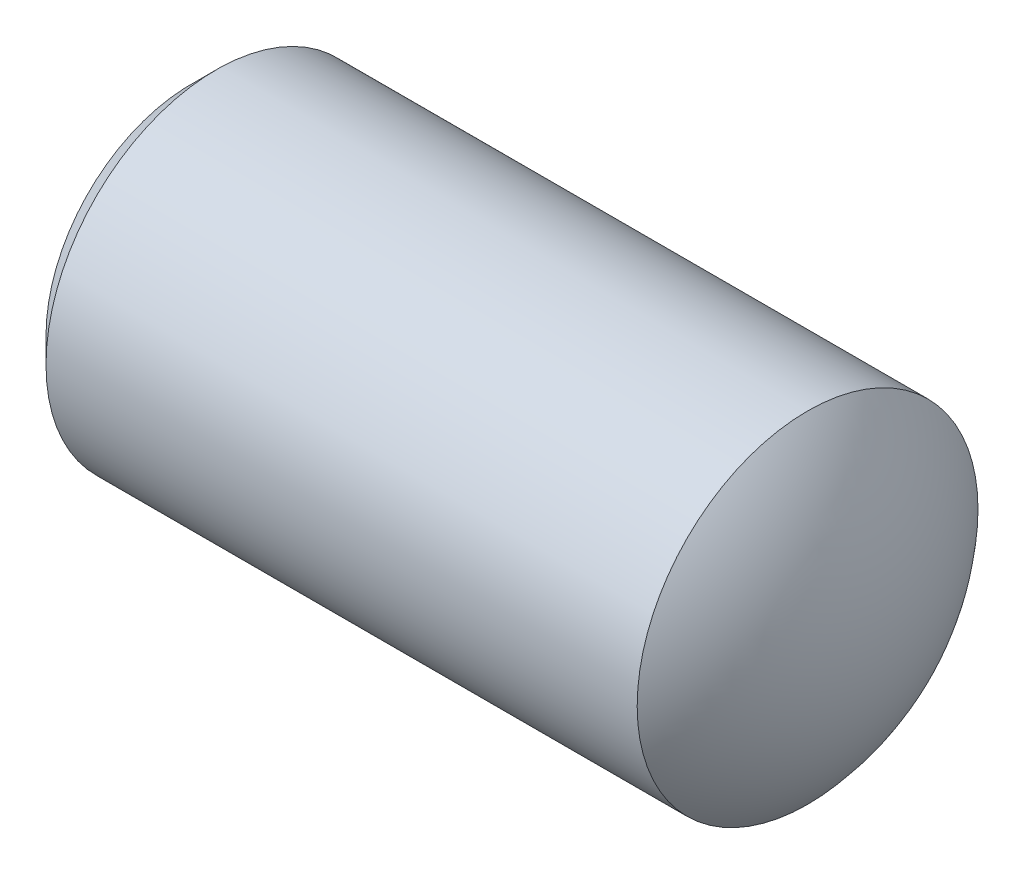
ISO-10303-21;
HEADER;
FILE_DESCRIPTION(('STEP AP214'),'2;1');
FILE_NAME('part.step','',(''),(''),'','','');
FILE_SCHEMA(('AUTOMOTIVE_DESIGN { 1 0 10303 214 1 1 1 1 }'));
ENDSEC;
DATA;
#1=APPLICATION_CONTEXT('core data for automotive mechanical design processes');
#2=APPLICATION_PROTOCOL_DEFINITION('international standard','automotive_design',2000,#1);
#3=PRODUCT_CONTEXT('',#1,'mechanical');
#4=PRODUCT('Part','Part','',(#3));
#5=PRODUCT_RELATED_PRODUCT_CATEGORY('part','',(#4));
#6=PRODUCT_DEFINITION_FORMATION('','',#4);
#7=PRODUCT_DEFINITION_CONTEXT('part definition',#1,'design');
#8=PRODUCT_DEFINITION('design','',#6,#7);
#9=PRODUCT_DEFINITION_SHAPE('','',#8);
#10=(LENGTH_UNIT() NAMED_UNIT(*) SI_UNIT(.MILLI.,.METRE.));
#11=(NAMED_UNIT(*) PLANE_ANGLE_UNIT() SI_UNIT($,.RADIAN.));
#12=(NAMED_UNIT(*) SI_UNIT($,.STERADIAN.) SOLID_ANGLE_UNIT());
#13=UNCERTAINTY_MEASURE_WITH_UNIT(LENGTH_MEASURE(1.E-05),#10,'distance_accuracy_value','');
#14=(GEOMETRIC_REPRESENTATION_CONTEXT(3) GLOBAL_UNCERTAINTY_ASSIGNED_CONTEXT((#13)) GLOBAL_UNIT_ASSIGNED_CONTEXT((#10,
#11,#12)) REPRESENTATION_CONTEXT('',''));
#15=CARTESIAN_POINT('',(0.,0.,0.));
#16=DIRECTION('',(0.,0.,1.));
#17=DIRECTION('',(1.,0.,0.));
#18=AXIS2_PLACEMENT_3D('',#15,#16,#17);
#19=CARTESIAN_POINT('',(0.,0.,0.));
#20=DIRECTION('',(-1.,0.,0.));
#21=DIRECTION('',(0.,0.,1.));
#22=AXIS2_PLACEMENT_3D('',#19,#20,#21);
#23=PLANE('',#22);
#24=CARTESIAN_POINT('',(0.,0.,0.));
#25=DIRECTION('',(-1.,0.,0.));
#26=DIRECTION('',(0.,0.,1.));
#27=AXIS2_PLACEMENT_3D('',#24,#25,#26);
#28=CIRCLE('',#27,10.81024);
#29=CARTESIAN_POINT('',(0.,0.,10.81024));
#30=VERTEX_POINT('',#29);
#31=EDGE_CURVE('E160',#30,#30,#28,.T.);
#32=ORIENTED_EDGE('',*,*,#31,.T.);
#33=EDGE_LOOP('',(#32));
#34=FACE_BOUND('',#33,.T.);
#35=DIRECTION('',(0.,0.,-1.));
#36=VECTOR('',#35,1.);
#37=CARTESIAN_POINT('',(0.,7.1374,4.12077981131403));
#38=LINE('',#37,#36);
#39=CARTESIAN_POINT('',(0.,7.1374,4.12077981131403));
#40=VERTEX_POINT('',#39);
#41=CARTESIAN_POINT('',(0.,7.1374,-4.12077981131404));
#42=VERTEX_POINT('',#41);
#43=EDGE_CURVE('E149',#40,#42,#38,.T.);
#44=ORIENTED_EDGE('',*,*,#43,.F.);
#45=DIRECTION('',(0.,-0.866025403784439,0.5));
#46=VECTOR('',#45,1.);
#47=CARTESIAN_POINT('',(0.,7.1374,4.12077981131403));
#48=LINE('',#47,#46);
#49=CARTESIAN_POINT('',(0.,0.,8.24155962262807));
#50=VERTEX_POINT('',#49);
#51=EDGE_CURVE('E60',#40,#50,#48,.T.);
#52=ORIENTED_EDGE('',*,*,#51,.T.);
#53=DIRECTION('',(0.,0.866025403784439,0.5));
#54=VECTOR('',#53,1.);
#55=CARTESIAN_POINT('',(0.,-7.13739999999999,4.12077981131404));
#56=LINE('',#55,#54);
#57=CARTESIAN_POINT('',(0.,-7.13739999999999,4.12077981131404));
#58=VERTEX_POINT('',#57);
#59=EDGE_CURVE('E132',#58,#50,#56,.T.);
#60=ORIENTED_EDGE('',*,*,#59,.F.);
#61=DIRECTION('',(0.,0.,-1.));
#62=VECTOR('',#61,1.);
#63=CARTESIAN_POINT('',(0.,-7.13739999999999,4.12077981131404));
#64=LINE('',#63,#62);
#65=CARTESIAN_POINT('',(0.,-7.13739999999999,-4.12077981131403));
#66=VERTEX_POINT('',#65);
#67=EDGE_CURVE('E139',#58,#66,#64,.T.);
#68=ORIENTED_EDGE('',*,*,#67,.T.);
#69=DIRECTION('',(0.,0.866025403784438,-0.500000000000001));
#70=VECTOR('',#69,1.);
#71=CARTESIAN_POINT('',(0.,-7.13739999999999,-4.12077981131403));
#72=LINE('',#71,#70);
#73=CARTESIAN_POINT('',(0.,0.,-8.24155962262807));
#74=VERTEX_POINT('',#73);
#75=EDGE_CURVE('E145',#66,#74,#72,.T.);
#76=ORIENTED_EDGE('',*,*,#75,.T.);
#77=DIRECTION('',(0.,-0.866025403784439,-0.5));
#78=VECTOR('',#77,1.);
#79=CARTESIAN_POINT('',(0.,7.1374,-4.12077981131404));
#80=LINE('',#79,#78);
#81=EDGE_CURVE('E116',#42,#74,#80,.T.);
#82=ORIENTED_EDGE('',*,*,#81,.F.);
#83=EDGE_LOOP('',(#44,#52,#60,#68,#76,#82));
#84=FACE_BOUND('',#83,.T.);
#85=ADVANCED_FACE('F41',(#34,#84),#23,.T.);
#86=CARTESIAN_POINT('',(31.75,0.,0.));
#87=DIRECTION('',(-1.,0.,0.));
#88=DIRECTION('',(0.,1.,0.));
#89=AXIS2_PLACEMENT_3D('',#86,#87,#88);
#90=SPHERICAL_SURFACE('',#89,19.05);
#91=CARTESIAN_POINT('',(45.9490316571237,0.,0.));
#92=DIRECTION('',(-1.,0.,0.));
#93=DIRECTION('',(0.,0.,1.));
#94=AXIS2_PLACEMENT_3D('',#91,#92,#93);
#95=CIRCLE('',#94,12.7);
#96=CARTESIAN_POINT('',(45.9490316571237,0.,12.7));
#97=VERTEX_POINT('',#96);
#98=EDGE_CURVE('E11',#97,#97,#95,.T.);
#99=ORIENTED_EDGE('',*,*,#98,.F.);
#100=EDGE_LOOP('',(#99));
#101=FACE_BOUND('',#100,.T.);
#102=ADVANCED_FACE('F43',(#101),#90,.T.);
#103=CARTESIAN_POINT('',(-12.7,0.,0.));
#104=DIRECTION('',(-1.,0.,0.));
#105=DIRECTION('',(0.,0.,1.));
#106=AXIS2_PLACEMENT_3D('',#103,#104,#105);
#107=CYLINDRICAL_SURFACE('',#106,12.7);
#108=ORIENTED_EDGE('',*,*,#98,.T.);
#109=EDGE_LOOP('',(#108));
#110=FACE_BOUND('',#109,.T.);
#111=CARTESIAN_POINT('',(1.88976,0.,0.));
#112=DIRECTION('',(-1.,0.,0.));
#113=DIRECTION('',(0.,0.,1.));
#114=AXIS2_PLACEMENT_3D('',#111,#112,#113);
#115=CIRCLE('',#114,12.7);
#116=CARTESIAN_POINT('',(1.88976,0.,12.7));
#117=VERTEX_POINT('',#116);
#118=EDGE_CURVE('E49',#117,#117,#115,.T.);
#119=ORIENTED_EDGE('',*,*,#118,.F.);
#120=EDGE_LOOP('',(#119));
#121=FACE_BOUND('',#120,.T.);
#122=ADVANCED_FACE('F171',(#110,#121),#107,.T.);
#123=CARTESIAN_POINT('',(0.,0.,0.));
#124=DIRECTION('',(1.,0.,0.));
#125=DIRECTION('',(0.,0.,-1.));
#126=AXIS2_PLACEMENT_3D('',#123,#124,#125);
#127=CONICAL_SURFACE('',#126,10.81024,0.785398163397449);
#128=ORIENTED_EDGE('',*,*,#118,.T.);
#129=EDGE_LOOP('',(#128));
#130=FACE_BOUND('',#129,.T.);
#131=ORIENTED_EDGE('',*,*,#31,.F.);
#132=EDGE_LOOP('',(#131));
#133=FACE_BOUND('',#132,.T.);
#134=ADVANCED_FACE('F166',(#130,#133),#127,.T.);
#135=CARTESIAN_POINT('',(14.2748,7.1374,4.12077981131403));
#136=DIRECTION('',(0.,-0.5,-0.866025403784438));
#137=DIRECTION('',(0.,0.866025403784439,-0.5));
#138=AXIS2_PLACEMENT_3D('',#135,#136,#137);
#139=PLANE('',#138);
#140=ORIENTED_EDGE('',*,*,#51,.F.);
#141=DIRECTION('',(-1.,0.,0.));
#142=VECTOR('',#141,1.);
#143=CARTESIAN_POINT('',(14.2748,7.1374,4.12077981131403));
#144=LINE('',#143,#142);
#145=CARTESIAN_POINT('',(14.2748,7.1374,4.12077981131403));
#146=VERTEX_POINT('',#145);
#147=EDGE_CURVE('E61',#146,#40,#144,.T.);
#148=ORIENTED_EDGE('',*,*,#147,.F.);
#149=DIRECTION('',(0.,-0.866025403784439,0.5));
#150=VECTOR('',#149,1.);
#151=CARTESIAN_POINT('',(14.2748,7.1374,4.12077981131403));
#152=LINE('',#151,#150);
#153=CARTESIAN_POINT('',(14.2748,0.,8.24155962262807));
#154=VERTEX_POINT('',#153);
#155=EDGE_CURVE('E87',#146,#154,#152,.T.);
#156=ORIENTED_EDGE('',*,*,#155,.T.);
#157=DIRECTION('',(-1.,0.,0.));
#158=VECTOR('',#157,1.);
#159=CARTESIAN_POINT('',(14.2748,0.,8.24155962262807));
#160=LINE('',#159,#158);
#161=EDGE_CURVE('E157',#154,#50,#160,.T.);
#162=ORIENTED_EDGE('',*,*,#161,.T.);
#163=EDGE_LOOP('',(#140,#148,#156,#162));
#164=FACE_BOUND('',#163,.T.);
#165=ADVANCED_FACE('F178',(#164),#139,.T.);
#166=CARTESIAN_POINT('',(14.2748,-7.13739999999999,4.12077981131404));
#167=DIRECTION('',(0.,-0.5,0.866025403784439));
#168=DIRECTION('',(0.,-0.866025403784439,-0.5));
#169=AXIS2_PLACEMENT_3D('',#166,#167,#168);
#170=PLANE('',#169);
#171=ORIENTED_EDGE('',*,*,#59,.T.);
#172=ORIENTED_EDGE('',*,*,#161,.F.);
#173=DIRECTION('',(0.,0.866025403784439,0.5));
#174=VECTOR('',#173,1.);
#175=CARTESIAN_POINT('',(14.2748,-7.13739999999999,4.12077981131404));
#176=LINE('',#175,#174);
#177=CARTESIAN_POINT('',(14.2748,-7.13739999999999,4.12077981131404));
#178=VERTEX_POINT('',#177);
#179=EDGE_CURVE('E273',#178,#154,#176,.T.);
#180=ORIENTED_EDGE('',*,*,#179,.F.);
#181=DIRECTION('',(-1.,0.,0.));
#182=VECTOR('',#181,1.);
#183=CARTESIAN_POINT('',(14.2748,-7.13739999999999,4.12077981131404));
#184=LINE('',#183,#182);
#185=EDGE_CURVE('E152',#178,#58,#184,.T.);
#186=ORIENTED_EDGE('',*,*,#185,.T.);
#187=EDGE_LOOP('',(#171,#172,#180,#186));
#188=FACE_BOUND('',#187,.T.);
#189=ADVANCED_FACE('F188',(#188),#170,.F.);
#190=CARTESIAN_POINT('',(14.2748,-7.13739999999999,4.12077981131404));
#191=DIRECTION('',(0.,1.,0.));
#192=DIRECTION('',(0.,0.,1.));
#193=AXIS2_PLACEMENT_3D('',#190,#191,#192);
#194=PLANE('',#193);
#195=ORIENTED_EDGE('',*,*,#67,.F.);
#196=ORIENTED_EDGE('',*,*,#185,.F.);
#197=DIRECTION('',(0.,0.,-1.));
#198=VECTOR('',#197,1.);
#199=CARTESIAN_POINT('',(14.2748,-7.13739999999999,4.12077981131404));
#200=LINE('',#199,#198);
#201=CARTESIAN_POINT('',(14.2748,-7.13739999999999,-4.12077981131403));
#202=VERTEX_POINT('',#201);
#203=EDGE_CURVE('E111',#178,#202,#200,.T.);
#204=ORIENTED_EDGE('',*,*,#203,.T.);
#205=DIRECTION('',(-1.,0.,0.));
#206=VECTOR('',#205,1.);
#207=CARTESIAN_POINT('',(14.2748,-7.13739999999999,-4.12077981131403));
#208=LINE('',#207,#206);
#209=EDGE_CURVE('E102',#202,#66,#208,.T.);
#210=ORIENTED_EDGE('',*,*,#209,.T.);
#211=EDGE_LOOP('',(#195,#196,#204,#210));
#212=FACE_BOUND('',#211,.T.);
#213=ADVANCED_FACE('F195',(#212),#194,.T.);
#214=CARTESIAN_POINT('',(14.2748,-7.13739999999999,-4.12077981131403));
#215=DIRECTION('',(0.,0.500000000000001,0.866025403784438));
#216=DIRECTION('',(0.,-0.866025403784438,0.500000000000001));
#217=AXIS2_PLACEMENT_3D('',#214,#215,#216);
#218=PLANE('',#217);
#219=ORIENTED_EDGE('',*,*,#75,.F.);
#220=ORIENTED_EDGE('',*,*,#209,.F.);
#221=DIRECTION('',(0.,0.866025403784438,-0.500000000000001));
#222=VECTOR('',#221,1.);
#223=CARTESIAN_POINT('',(14.2748,-7.13739999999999,-4.12077981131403));
#224=LINE('',#223,#222);
#225=CARTESIAN_POINT('',(14.2748,0.,-8.24155962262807));
#226=VERTEX_POINT('',#225);
#227=EDGE_CURVE('E99',#202,#226,#224,.T.);
#228=ORIENTED_EDGE('',*,*,#227,.T.);
#229=DIRECTION('',(-1.,0.,0.));
#230=VECTOR('',#229,1.);
#231=CARTESIAN_POINT('',(14.2748,0.,-8.24155962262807));
#232=LINE('',#231,#230);
#233=EDGE_CURVE('E104',#226,#74,#232,.T.);
#234=ORIENTED_EDGE('',*,*,#233,.T.);
#235=EDGE_LOOP('',(#219,#220,#228,#234));
#236=FACE_BOUND('',#235,.T.);
#237=ADVANCED_FACE('F101',(#236),#218,.T.);
#238=CARTESIAN_POINT('',(14.2748,7.1374,-4.12077981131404));
#239=DIRECTION('',(0.,0.5,-0.866025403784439));
#240=DIRECTION('',(0.,0.866025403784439,0.5));
#241=AXIS2_PLACEMENT_3D('',#238,#239,#240);
#242=PLANE('',#241);
#243=ORIENTED_EDGE('',*,*,#81,.T.);
#244=ORIENTED_EDGE('',*,*,#233,.F.);
#245=DIRECTION('',(0.,-0.866025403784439,-0.5));
#246=VECTOR('',#245,1.);
#247=CARTESIAN_POINT('',(14.2748,7.1374,-4.12077981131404));
#248=LINE('',#247,#246);
#249=CARTESIAN_POINT('',(14.2748,7.1374,-4.12077981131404));
#250=VERTEX_POINT('',#249);
#251=EDGE_CURVE('E109',#250,#226,#248,.T.);
#252=ORIENTED_EDGE('',*,*,#251,.F.);
#253=DIRECTION('',(-1.,0.,0.));
#254=VECTOR('',#253,1.);
#255=CARTESIAN_POINT('',(14.2748,7.1374,-4.12077981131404));
#256=LINE('',#255,#254);
#257=EDGE_CURVE('E82',#250,#42,#256,.T.);
#258=ORIENTED_EDGE('',*,*,#257,.T.);
#259=EDGE_LOOP('',(#243,#244,#252,#258));
#260=FACE_BOUND('',#259,.T.);
#261=ADVANCED_FACE('F113',(#260),#242,.F.);
#262=CARTESIAN_POINT('',(14.2748,7.1374,4.12077981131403));
#263=DIRECTION('',(0.,1.,0.));
#264=DIRECTION('',(0.,0.,1.));
#265=AXIS2_PLACEMENT_3D('',#262,#263,#264);
#266=PLANE('',#265);
#267=ORIENTED_EDGE('',*,*,#43,.T.);
#268=ORIENTED_EDGE('',*,*,#257,.F.);
#269=DIRECTION('',(0.,0.,-1.));
#270=VECTOR('',#269,1.);
#271=CARTESIAN_POINT('',(14.2748,7.1374,4.12077981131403));
#272=LINE('',#271,#270);
#273=EDGE_CURVE('E125',#146,#250,#272,.T.);
#274=ORIENTED_EDGE('',*,*,#273,.F.);
#275=ORIENTED_EDGE('',*,*,#147,.T.);
#276=EDGE_LOOP('',(#267,#268,#274,#275));
#277=FACE_BOUND('',#276,.T.);
#278=ADVANCED_FACE('F202',(#277),#266,.F.);
#279=CARTESIAN_POINT('',(14.2748,14.2748,0.));
#280=DIRECTION('',(1.,0.,0.));
#281=DIRECTION('',(0.,0.,-1.));
#282=AXIS2_PLACEMENT_3D('',#279,#280,#281);
#283=PLANE('',#282);
#284=ORIENTED_EDGE('',*,*,#155,.F.);
#285=ORIENTED_EDGE('',*,*,#273,.T.);
#286=ORIENTED_EDGE('',*,*,#251,.T.);
#287=ORIENTED_EDGE('',*,*,#227,.F.);
#288=ORIENTED_EDGE('',*,*,#203,.F.);
#289=ORIENTED_EDGE('',*,*,#179,.T.);
#290=EDGE_LOOP('',(#284,#285,#286,#287,#288,#289));
#291=FACE_BOUND('',#290,.T.);
#292=ADVANCED_FACE('F119',(#291),#283,.F.);
#293=CLOSED_SHELL('',(#85,#102,#122,#134,#165,#189,#213,#237,#261,#278,#292));
#294=MANIFOLD_SOLID_BREP('B2',#293);
#295=ADVANCED_BREP_SHAPE_REPRESENTATION('',(#18,#294),#14);
#296=SHAPE_DEFINITION_REPRESENTATION(#9,#295);
ENDSEC;
END-ISO-10303-21;
